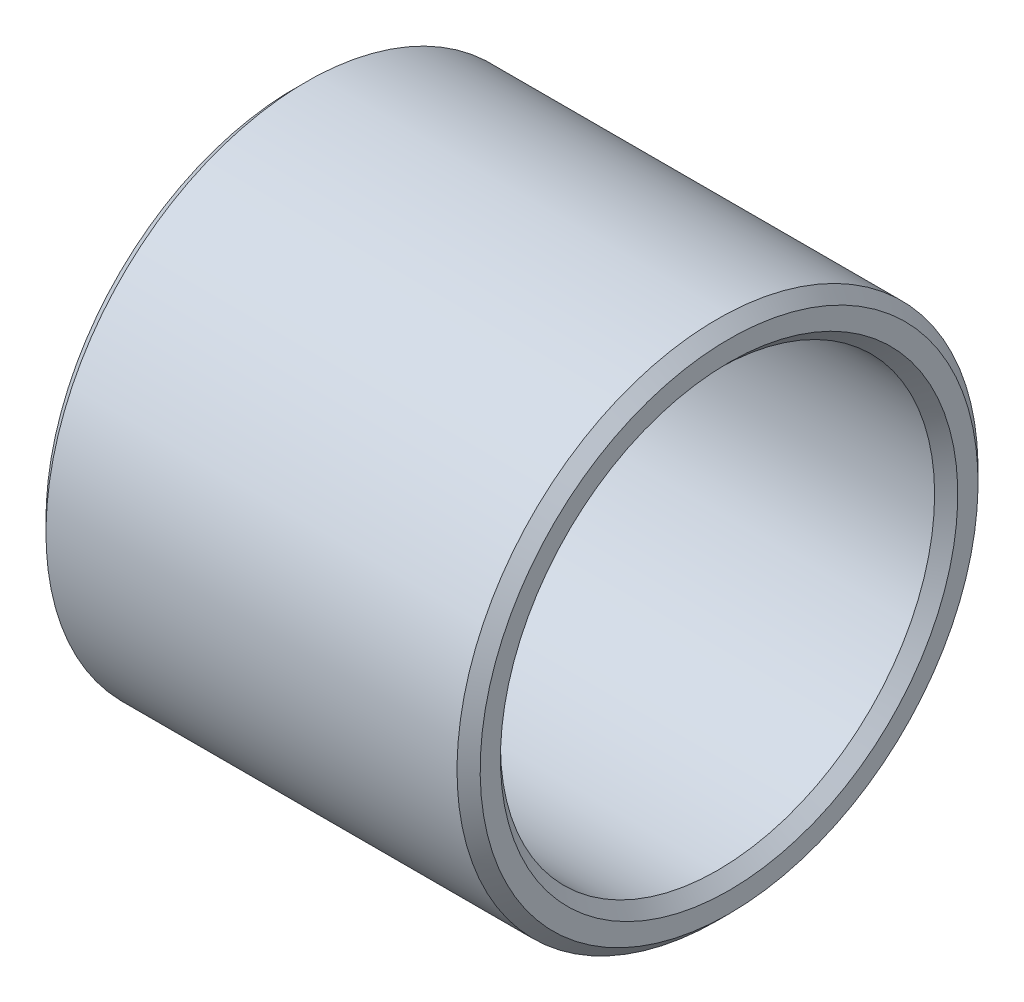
ISO-10303-21;
HEADER;
FILE_DESCRIPTION(('STEP AP214'),'2;1');
FILE_NAME('part.step','',(''),(''),'','','');
FILE_SCHEMA(('AUTOMOTIVE_DESIGN { 1 0 10303 214 1 1 1 1 }'));
ENDSEC;
DATA;
#1=APPLICATION_CONTEXT('core data for automotive mechanical design processes');
#2=APPLICATION_PROTOCOL_DEFINITION('international standard','automotive_design',2000,#1);
#3=PRODUCT_CONTEXT('',#1,'mechanical');
#4=PRODUCT('Part','Part','',(#3));
#5=PRODUCT_RELATED_PRODUCT_CATEGORY('part','',(#4));
#6=PRODUCT_DEFINITION_FORMATION('','',#4);
#7=PRODUCT_DEFINITION_CONTEXT('part definition',#1,'design');
#8=PRODUCT_DEFINITION('design','',#6,#7);
#9=PRODUCT_DEFINITION_SHAPE('','',#8);
#10=(LENGTH_UNIT() NAMED_UNIT(*) SI_UNIT(.MILLI.,.METRE.));
#11=(NAMED_UNIT(*) PLANE_ANGLE_UNIT() SI_UNIT($,.RADIAN.));
#12=(NAMED_UNIT(*) SI_UNIT($,.STERADIAN.) SOLID_ANGLE_UNIT());
#13=UNCERTAINTY_MEASURE_WITH_UNIT(LENGTH_MEASURE(1.E-05),#10,'distance_accuracy_value','');
#14=(GEOMETRIC_REPRESENTATION_CONTEXT(3) GLOBAL_UNCERTAINTY_ASSIGNED_CONTEXT((#13)) GLOBAL_UNIT_ASSIGNED_CONTEXT((#10,
#11,#12)) REPRESENTATION_CONTEXT('',''));
#15=CARTESIAN_POINT('',(0.,0.,0.));
#16=DIRECTION('',(0.,0.,1.));
#17=DIRECTION('',(1.,0.,0.));
#18=AXIS2_PLACEMENT_3D('',#15,#16,#17);
#19=CARTESIAN_POINT('',(0.,-8.25,0.));
#20=DIRECTION('',(-1.,0.,0.));
#21=DIRECTION('',(0.,1.,0.));
#22=AXIS2_PLACEMENT_3D('',#19,#20,#21);
#23=PLANE('',#22);
#24=CARTESIAN_POINT('',(0.,0.,0.));
#25=DIRECTION('',(1.,0.,0.));
#26=DIRECTION('',(0.,-1.,0.));
#27=AXIS2_PLACEMENT_3D('',#24,#25,#26);
#28=CIRCLE('',#27,7.9);
#29=CARTESIAN_POINT('',(0.,-7.9,0.));
#30=VERTEX_POINT('',#29);
#31=EDGE_CURVE('E9',#30,#30,#28,.T.);
#32=ORIENTED_EDGE('',*,*,#31,.T.);
#33=EDGE_LOOP('',(#32));
#34=FACE_BOUND('',#33,.T.);
#35=CARTESIAN_POINT('',(0.,0.,0.));
#36=DIRECTION('',(1.,0.,0.));
#37=DIRECTION('',(0.,-1.,0.));
#38=AXIS2_PLACEMENT_3D('',#35,#36,#37);
#39=CIRCLE('',#38,8.6);
#40=CARTESIAN_POINT('',(0.,-8.6,0.));
#41=VERTEX_POINT('',#40);
#42=EDGE_CURVE('E57',#41,#41,#39,.T.);
#43=ORIENTED_EDGE('',*,*,#42,.F.);
#44=EDGE_LOOP('',(#43));
#45=FACE_BOUND('',#44,.T.);
#46=ADVANCED_FACE('F15',(#34,#45),#23,.T.);
#47=CARTESIAN_POINT('',(0.2,0.,0.));
#48=DIRECTION('',(-1.,0.,0.));
#49=DIRECTION('',(0.,-1.,0.));
#50=AXIS2_PLACEMENT_3D('',#47,#48,#49);
#51=CONICAL_SURFACE('',#50,7.7,0.785398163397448);
#52=CARTESIAN_POINT('',(0.4,0.,0.));
#53=DIRECTION('',(1.,0.,0.));
#54=DIRECTION('',(0.,-1.,0.));
#55=AXIS2_PLACEMENT_3D('',#52,#53,#54);
#56=CIRCLE('',#55,7.5);
#57=CARTESIAN_POINT('',(0.4,-7.5,0.));
#58=VERTEX_POINT('',#57);
#59=EDGE_CURVE('E19',#58,#58,#56,.T.);
#60=ORIENTED_EDGE('',*,*,#59,.T.);
#61=EDGE_LOOP('',(#60));
#62=FACE_BOUND('',#61,.T.);
#63=ORIENTED_EDGE('',*,*,#31,.F.);
#64=EDGE_LOOP('',(#63));
#65=FACE_BOUND('',#64,.T.);
#66=ADVANCED_FACE('F17',(#62,#65),#51,.F.);
#67=CARTESIAN_POINT('',(7.5,0.,0.));
#68=DIRECTION('',(-1.,0.,0.));
#69=DIRECTION('',(0.,-1.,0.));
#70=AXIS2_PLACEMENT_3D('',#67,#68,#69);
#71=CYLINDRICAL_SURFACE('',#70,7.5);
#72=CARTESIAN_POINT('',(14.6,0.,0.));
#73=DIRECTION('',(1.,0.,0.));
#74=DIRECTION('',(0.,-1.,0.));
#75=AXIS2_PLACEMENT_3D('',#72,#73,#74);
#76=CIRCLE('',#75,7.5);
#77=CARTESIAN_POINT('',(14.6,-7.5,0.));
#78=VERTEX_POINT('',#77);
#79=EDGE_CURVE('E47',#78,#78,#76,.T.);
#80=ORIENTED_EDGE('',*,*,#79,.T.);
#81=EDGE_LOOP('',(#80));
#82=FACE_BOUND('',#81,.T.);
#83=ORIENTED_EDGE('',*,*,#59,.F.);
#84=EDGE_LOOP('',(#83));
#85=FACE_BOUND('',#84,.T.);
#86=ADVANCED_FACE('F48',(#82,#85),#71,.F.);
#87=CARTESIAN_POINT('',(14.8,0.,0.));
#88=DIRECTION('',(1.,0.,0.));
#89=DIRECTION('',(0.,-1.,0.));
#90=AXIS2_PLACEMENT_3D('',#87,#88,#89);
#91=CONICAL_SURFACE('',#90,7.7,0.7853981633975);
#92=CARTESIAN_POINT('',(15.,0.,0.));
#93=DIRECTION('',(1.,0.,0.));
#94=DIRECTION('',(0.,-1.,0.));
#95=AXIS2_PLACEMENT_3D('',#92,#93,#94);
#96=CIRCLE('',#95,7.9);
#97=CARTESIAN_POINT('',(15.,-7.9,0.));
#98=VERTEX_POINT('',#97);
#99=EDGE_CURVE('E51',#98,#98,#96,.T.);
#100=ORIENTED_EDGE('',*,*,#99,.T.);
#101=EDGE_LOOP('',(#100));
#102=FACE_BOUND('',#101,.T.);
#103=ORIENTED_EDGE('',*,*,#79,.F.);
#104=EDGE_LOOP('',(#103));
#105=FACE_BOUND('',#104,.T.);
#106=ADVANCED_FACE('F87',(#102,#105),#91,.F.);
#107=CARTESIAN_POINT('',(15.,-8.25,0.));
#108=DIRECTION('',(1.,0.,0.));
#109=DIRECTION('',(0.,-1.,0.));
#110=AXIS2_PLACEMENT_3D('',#107,#108,#109);
#111=PLANE('',#110);
#112=CARTESIAN_POINT('',(15.,0.,0.));
#113=DIRECTION('',(1.,0.,0.));
#114=DIRECTION('',(0.,-1.,0.));
#115=AXIS2_PLACEMENT_3D('',#112,#113,#114);
#116=CIRCLE('',#115,8.6);
#117=CARTESIAN_POINT('',(15.,-8.6,0.));
#118=VERTEX_POINT('',#117);
#119=EDGE_CURVE('E53',#118,#118,#116,.T.);
#120=ORIENTED_EDGE('',*,*,#119,.T.);
#121=EDGE_LOOP('',(#120));
#122=FACE_BOUND('',#121,.T.);
#123=ORIENTED_EDGE('',*,*,#99,.F.);
#124=EDGE_LOOP('',(#123));
#125=FACE_BOUND('',#124,.T.);
#126=ADVANCED_FACE('F90',(#122,#125),#111,.T.);
#127=CARTESIAN_POINT('',(14.8,0.,0.));
#128=DIRECTION('',(-1.,0.,0.));
#129=DIRECTION('',(0.,-1.,0.));
#130=AXIS2_PLACEMENT_3D('',#127,#128,#129);
#131=CONICAL_SURFACE('',#130,8.8,0.7853981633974);
#132=CARTESIAN_POINT('',(14.6,0.,0.));
#133=DIRECTION('',(1.,0.,0.));
#134=DIRECTION('',(0.,-1.,0.));
#135=AXIS2_PLACEMENT_3D('',#132,#133,#134);
#136=CIRCLE('',#135,9.);
#137=CARTESIAN_POINT('',(14.6,-9.,0.));
#138=VERTEX_POINT('',#137);
#139=EDGE_CURVE('E58',#138,#138,#136,.T.);
#140=ORIENTED_EDGE('',*,*,#139,.T.);
#141=EDGE_LOOP('',(#140));
#142=FACE_BOUND('',#141,.T.);
#143=ORIENTED_EDGE('',*,*,#119,.F.);
#144=EDGE_LOOP('',(#143));
#145=FACE_BOUND('',#144,.T.);
#146=ADVANCED_FACE('F76',(#142,#145),#131,.T.);
#147=CARTESIAN_POINT('',(7.5,0.,0.));
#148=DIRECTION('',(-1.,0.,0.));
#149=DIRECTION('',(0.,-1.,0.));
#150=AXIS2_PLACEMENT_3D('',#147,#148,#149);
#151=CYLINDRICAL_SURFACE('',#150,9.);
#152=CARTESIAN_POINT('',(0.4,0.,0.));
#153=DIRECTION('',(1.,0.,0.));
#154=DIRECTION('',(0.,-1.,0.));
#155=AXIS2_PLACEMENT_3D('',#152,#153,#154);
#156=CIRCLE('',#155,9.);
#157=CARTESIAN_POINT('',(0.4,-9.,0.));
#158=VERTEX_POINT('',#157);
#159=EDGE_CURVE('E59',#158,#158,#156,.T.);
#160=ORIENTED_EDGE('',*,*,#159,.T.);
#161=EDGE_LOOP('',(#160));
#162=FACE_BOUND('',#161,.T.);
#163=ORIENTED_EDGE('',*,*,#139,.F.);
#164=EDGE_LOOP('',(#163));
#165=FACE_BOUND('',#164,.T.);
#166=ADVANCED_FACE('F67',(#162,#165),#151,.T.);
#167=CARTESIAN_POINT('',(0.2,0.,0.));
#168=DIRECTION('',(1.,0.,0.));
#169=DIRECTION('',(0.,-1.,0.));
#170=AXIS2_PLACEMENT_3D('',#167,#168,#169);
#171=CONICAL_SURFACE('',#170,8.8,0.785398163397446);
#172=ORIENTED_EDGE('',*,*,#42,.T.);
#173=EDGE_LOOP('',(#172));
#174=FACE_BOUND('',#173,.T.);
#175=ORIENTED_EDGE('',*,*,#159,.F.);
#176=EDGE_LOOP('',(#175));
#177=FACE_BOUND('',#176,.T.);
#178=ADVANCED_FACE('F70',(#174,#177),#171,.T.);
#179=CLOSED_SHELL('',(#46,#66,#86,#106,#126,#146,#166,#178));
#180=MANIFOLD_SOLID_BREP('B1',#179);
#181=ADVANCED_BREP_SHAPE_REPRESENTATION('',(#18,#180),#14);
#182=SHAPE_DEFINITION_REPRESENTATION(#9,#181);
ENDSEC;
END-ISO-10303-21;
